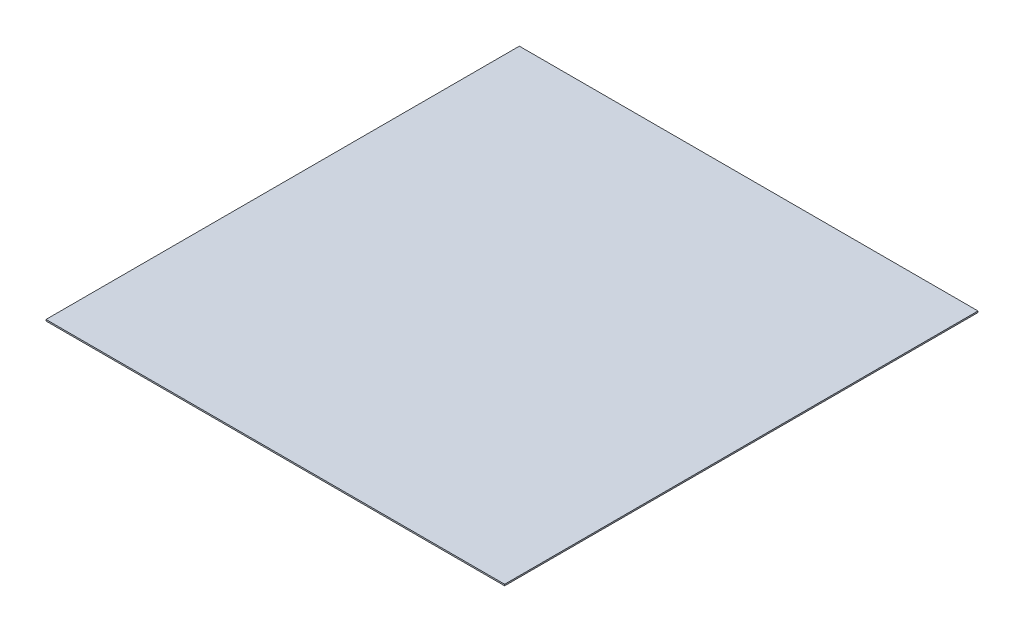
ISO-10303-21;
HEADER;
FILE_DESCRIPTION(('STEP AP214'),'2;1');
FILE_NAME('part.step','',(''),(''),'','','');
FILE_SCHEMA(('AUTOMOTIVE_DESIGN { 1 0 10303 214 1 1 1 1 }'));
ENDSEC;
DATA;
#1=APPLICATION_CONTEXT('core data for automotive mechanical design processes');
#2=APPLICATION_PROTOCOL_DEFINITION('international standard','automotive_design',2000,#1);
#3=PRODUCT_CONTEXT('',#1,'mechanical');
#4=PRODUCT('Part','Part','',(#3));
#5=PRODUCT_RELATED_PRODUCT_CATEGORY('part','',(#4));
#6=PRODUCT_DEFINITION_FORMATION('','',#4);
#7=PRODUCT_DEFINITION_CONTEXT('part definition',#1,'design');
#8=PRODUCT_DEFINITION('design','',#6,#7);
#9=PRODUCT_DEFINITION_SHAPE('','',#8);
#10=(LENGTH_UNIT() NAMED_UNIT(*) SI_UNIT(.MILLI.,.METRE.));
#11=(NAMED_UNIT(*) PLANE_ANGLE_UNIT() SI_UNIT($,.RADIAN.));
#12=(NAMED_UNIT(*) SI_UNIT($,.STERADIAN.) SOLID_ANGLE_UNIT());
#13=UNCERTAINTY_MEASURE_WITH_UNIT(LENGTH_MEASURE(1.E-05),#10,'distance_accuracy_value','');
#14=(GEOMETRIC_REPRESENTATION_CONTEXT(3) GLOBAL_UNCERTAINTY_ASSIGNED_CONTEXT((#13)) GLOBAL_UNIT_ASSIGNED_CONTEXT((#10,
#11,#12)) REPRESENTATION_CONTEXT('',''));
#15=CARTESIAN_POINT('',(0.,0.,0.));
#16=DIRECTION('',(0.,0.,1.));
#17=DIRECTION('',(1.,0.,0.));
#18=AXIS2_PLACEMENT_3D('',#15,#16,#17);
#19=CARTESIAN_POINT('',(82.3654236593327,0.508000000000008,85.0058496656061));
#20=DIRECTION('',(-1.,0.,0.));
#21=DIRECTION('',(0.,0.,1.));
#22=AXIS2_PLACEMENT_3D('',#19,#20,#21);
#23=PLANE('',#22);
#24=DIRECTION('',(0.,0.,-1.));
#25=VECTOR('',#24,1.);
#26=CARTESIAN_POINT('',(82.3654236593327,0.,85.0058496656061));
#27=LINE('',#26,#25);
#28=CARTESIAN_POINT('',(82.3654236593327,0.,85.0058496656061));
#29=VERTEX_POINT('',#28);
#30=CARTESIAN_POINT('',(82.3654236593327,0.,-85.0058496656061));
#31=VERTEX_POINT('',#30);
#32=EDGE_CURVE('E107',#29,#31,#27,.T.);
#33=ORIENTED_EDGE('',*,*,#32,.T.);
#34=DIRECTION('',(0.,-1.,0.));
#35=VECTOR('',#34,1.);
#36=CARTESIAN_POINT('',(82.3654236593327,0.508000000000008,-85.0058496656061));
#37=LINE('',#36,#35);
#38=CARTESIAN_POINT('',(82.3654236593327,0.508000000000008,-85.0058496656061));
#39=VERTEX_POINT('',#38);
#40=EDGE_CURVE('E11',#39,#31,#37,.T.);
#41=ORIENTED_EDGE('',*,*,#40,.F.);
#42=DIRECTION('',(0.,0.,-1.));
#43=VECTOR('',#42,1.);
#44=CARTESIAN_POINT('',(82.3654236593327,0.508000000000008,85.0058496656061));
#45=LINE('',#44,#43);
#46=CARTESIAN_POINT('',(82.3654236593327,0.508000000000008,85.0058496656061));
#47=VERTEX_POINT('',#46);
#48=EDGE_CURVE('E91',#47,#39,#45,.T.);
#49=ORIENTED_EDGE('',*,*,#48,.F.);
#50=DIRECTION('',(0.,-1.,0.));
#51=VECTOR('',#50,1.);
#52=CARTESIAN_POINT('',(82.3654236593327,0.508000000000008,85.0058496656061));
#53=LINE('',#52,#51);
#54=EDGE_CURVE('E103',#47,#29,#53,.T.);
#55=ORIENTED_EDGE('',*,*,#54,.T.);
#56=EDGE_LOOP('',(#33,#41,#49,#55));
#57=FACE_BOUND('',#56,.T.);
#58=ADVANCED_FACE('F39',(#57),#23,.F.);
#59=CARTESIAN_POINT('',(-82.3654236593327,0.508000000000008,-85.0058496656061));
#60=DIRECTION('',(0.,0.,1.));
#61=DIRECTION('',(1.,0.,0.));
#62=AXIS2_PLACEMENT_3D('',#59,#60,#61);
#63=PLANE('',#62);
#64=DIRECTION('',(-1.,0.,0.));
#65=VECTOR('',#64,1.);
#66=CARTESIAN_POINT('',(-82.3654236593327,0.,-85.0058496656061));
#67=LINE('',#66,#65);
#68=CARTESIAN_POINT('',(-82.3654236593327,0.,-85.0058496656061));
#69=VERTEX_POINT('',#68);
#70=EDGE_CURVE('E96',#31,#69,#67,.T.);
#71=ORIENTED_EDGE('',*,*,#70,.T.);
#72=DIRECTION('',(0.,-1.,0.));
#73=VECTOR('',#72,1.);
#74=CARTESIAN_POINT('',(-82.3654236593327,0.508000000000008,-85.0058496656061));
#75=LINE('',#74,#73);
#76=CARTESIAN_POINT('',(-82.3654236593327,0.508000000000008,-85.0058496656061));
#77=VERTEX_POINT('',#76);
#78=EDGE_CURVE('E48',#77,#69,#75,.T.);
#79=ORIENTED_EDGE('',*,*,#78,.F.);
#80=DIRECTION('',(-1.,0.,0.));
#81=VECTOR('',#80,1.);
#82=CARTESIAN_POINT('',(-82.3654236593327,0.508000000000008,-85.0058496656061));
#83=LINE('',#82,#81);
#84=EDGE_CURVE('E86',#39,#77,#83,.T.);
#85=ORIENTED_EDGE('',*,*,#84,.F.);
#86=ORIENTED_EDGE('',*,*,#40,.T.);
#87=EDGE_LOOP('',(#71,#79,#85,#86));
#88=FACE_BOUND('',#87,.T.);
#89=ADVANCED_FACE('F95',(#88),#63,.F.);
#90=CARTESIAN_POINT('',(-82.3654236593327,0.508000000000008,85.0058496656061));
#91=DIRECTION('',(1.,0.,0.));
#92=DIRECTION('',(0.,0.,-1.));
#93=AXIS2_PLACEMENT_3D('',#90,#91,#92);
#94=PLANE('',#93);
#95=DIRECTION('',(0.,0.,1.));
#96=VECTOR('',#95,1.);
#97=CARTESIAN_POINT('',(-82.3654236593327,0.,85.0058496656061));
#98=LINE('',#97,#96);
#99=CARTESIAN_POINT('',(-82.3654236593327,0.,85.0058496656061));
#100=VERTEX_POINT('',#99);
#101=EDGE_CURVE('E73',#69,#100,#98,.T.);
#102=ORIENTED_EDGE('',*,*,#101,.T.);
#103=DIRECTION('',(0.,-1.,0.));
#104=VECTOR('',#103,1.);
#105=CARTESIAN_POINT('',(-82.3654236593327,0.508000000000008,85.0058496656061));
#106=LINE('',#105,#104);
#107=CARTESIAN_POINT('',(-82.3654236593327,0.508000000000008,85.0058496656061));
#108=VERTEX_POINT('',#107);
#109=EDGE_CURVE('E98',#108,#100,#106,.T.);
#110=ORIENTED_EDGE('',*,*,#109,.F.);
#111=DIRECTION('',(0.,0.,1.));
#112=VECTOR('',#111,1.);
#113=CARTESIAN_POINT('',(-82.3654236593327,0.508000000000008,85.0058496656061));
#114=LINE('',#113,#112);
#115=EDGE_CURVE('E89',#77,#108,#114,.T.);
#116=ORIENTED_EDGE('',*,*,#115,.F.);
#117=ORIENTED_EDGE('',*,*,#78,.T.);
#118=EDGE_LOOP('',(#102,#110,#116,#117));
#119=FACE_BOUND('',#118,.T.);
#120=ADVANCED_FACE('F99',(#119),#94,.F.);
#121=CARTESIAN_POINT('',(-82.3654236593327,0.508000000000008,85.0058496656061));
#122=DIRECTION('',(0.,0.,-1.));
#123=DIRECTION('',(-1.,0.,0.));
#124=AXIS2_PLACEMENT_3D('',#121,#122,#123);
#125=PLANE('',#124);
#126=DIRECTION('',(1.,0.,0.));
#127=VECTOR('',#126,1.);
#128=CARTESIAN_POINT('',(-82.3654236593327,0.,85.0058496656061));
#129=LINE('',#128,#127);
#130=EDGE_CURVE('E79',#100,#29,#129,.T.);
#131=ORIENTED_EDGE('',*,*,#130,.T.);
#132=ORIENTED_EDGE('',*,*,#54,.F.);
#133=DIRECTION('',(1.,0.,0.));
#134=VECTOR('',#133,1.);
#135=CARTESIAN_POINT('',(-82.3654236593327,0.508000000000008,85.0058496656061));
#136=LINE('',#135,#134);
#137=EDGE_CURVE('E56',#108,#47,#136,.T.);
#138=ORIENTED_EDGE('',*,*,#137,.F.);
#139=ORIENTED_EDGE('',*,*,#109,.T.);
#140=EDGE_LOOP('',(#131,#132,#138,#139));
#141=FACE_BOUND('',#140,.T.);
#142=ADVANCED_FACE('F120',(#141),#125,.F.);
#143=CARTESIAN_POINT('',(0.,0.508000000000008,0.));
#144=DIRECTION('',(0.,-1.,0.));
#145=DIRECTION('',(0.,0.,-1.));
#146=AXIS2_PLACEMENT_3D('',#143,#144,#145);
#147=PLANE('',#146);
#148=ORIENTED_EDGE('',*,*,#48,.T.);
#149=ORIENTED_EDGE('',*,*,#84,.T.);
#150=ORIENTED_EDGE('',*,*,#115,.T.);
#151=ORIENTED_EDGE('',*,*,#137,.T.);
#152=EDGE_LOOP('',(#148,#149,#150,#151));
#153=FACE_BOUND('',#152,.T.);
#154=ADVANCED_FACE('F87',(#153),#147,.F.);
#155=CARTESIAN_POINT('',(0.,0.,0.));
#156=DIRECTION('',(0.,-1.,0.));
#157=DIRECTION('',(0.,0.,-1.));
#158=AXIS2_PLACEMENT_3D('',#155,#156,#157);
#159=PLANE('',#158);
#160=ORIENTED_EDGE('',*,*,#32,.F.);
#161=ORIENTED_EDGE('',*,*,#130,.F.);
#162=ORIENTED_EDGE('',*,*,#101,.F.);
#163=ORIENTED_EDGE('',*,*,#70,.F.);
#164=EDGE_LOOP('',(#160,#161,#162,#163));
#165=FACE_BOUND('',#164,.T.);
#166=ADVANCED_FACE('F123',(#165),#159,.T.);
#167=CLOSED_SHELL('',(#58,#89,#120,#142,#154,#166));
#168=MANIFOLD_SOLID_BREP('B2',#167);
#169=ADVANCED_BREP_SHAPE_REPRESENTATION('',(#18,#168),#14);
#170=SHAPE_DEFINITION_REPRESENTATION(#9,#169);
ENDSEC;
END-ISO-10303-21;
